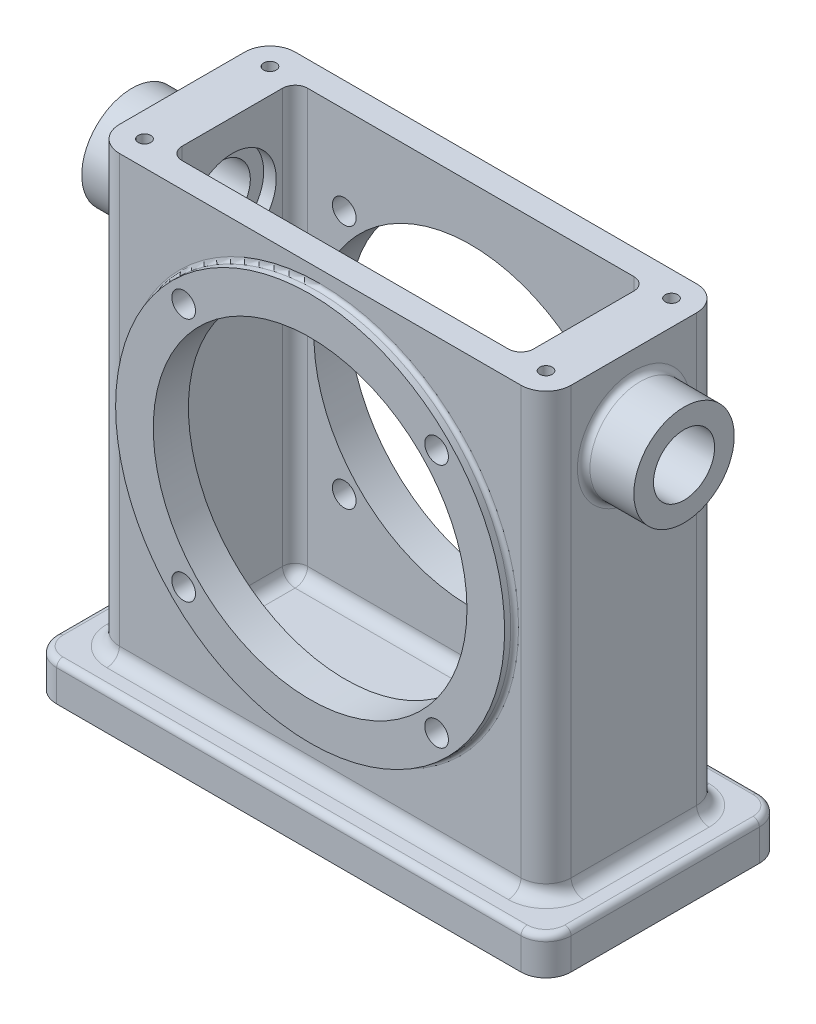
from build123d import *

# Parameters (mm, degrees)
SKETCH1_W                = 130.175
SKETCH1_H                = 60.325
BASE_EXTRUDE_DEPTH       = 9.525
SKETCH2_W                = 114.3
SKETCH2_H                = 44.45
BOSS_EXTRUDE1_DEPTH      = 111.125
FILLET1_R                = 6.35
FILLET2_R                = 1.5875
FILLET3_R                = 3.175
CUT_EXTRUDE1_DEPTH       = 107.95
FILLET4_R                = 3.175
SKETCH4_R                = 49.2125
BOSS_EXTRUDE2_DEPTH      = 2.54
SKETCH5_R                = 39.6875
CUT_EXTRUDE2_DEPTH       = 148.681533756
FILLET5_R                = 0.9906
SKETCH6_R                = 12.7
BOSS_EXTRUDE3_DEPTH      = 12.7
SKETCH7_R                = 7.7343
CUT_EXTRUDE3_DEPTH       = 166.724659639
SKETCH8_R                = 11.1125
CUT_EXTRUDE4_DEPTH       = 3.175
FILLET6_R                = 1.5875
F_6_0_6_DIAMETER_HOLE1_D = 6
SKETCH10_R               = 1.5875
CUT_EXTRUDE6_DEPTH       = 19.05


with BuildPart() as part:
    # Sketch1 → Base-Extrude (new body)
    with BuildSketch(Plane(origin=(0, 0, 0), x_dir=(1, 0, 0), z_dir=(0, 1, 0))):
        Rectangle(SKETCH1_W, SKETCH1_H)
    extrude(amount=BASE_EXTRUDE_DEPTH)

    # Sketch2 → Boss-Extrude1 (add)
    with BuildSketch(Plane(origin=(0, 9.525, 0), x_dir=(-1, 0, 0), z_dir=(0, 1, 0))):
        Rectangle(SKETCH2_W, SKETCH2_H)
    extrude(amount=BOSS_EXTRUDE1_DEPTH)

    # Fillet1
    fillet1_edges = [part.edges().sort_by_distance(p)[0] for p in [
        (-57.15, 65.0875, -22.225),
        (-57.15, 65.0875, 22.225),
        (57.15, 65.0875, 22.225),
        (57.15, 65.0875, -22.225),
        (-65.0875, 4.7625, -30.1625),
        (65.0875, 4.7625, -30.1625),
        (65.0875, 4.7625, 30.1625),
        (-65.0875, 4.7625, 30.1625),
    ]]
    fillet(fillet1_edges, radius=FILLET1_R)

    # Fillet2
    fillet2_edges = [part.edges().sort_by_distance(p)[0] for p in [
        (0, 9.525, 30.1625),
        (-65.0875, 9.525, 0),
        (65.0875, 9.525, 0),
        (0, 9.525, -30.1625),
        (-63.227628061, 9.525, -28.302628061),
        (63.227628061, 9.525, 28.302628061),
        (63.227628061, 9.525, -28.302628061),
        (-63.227628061, 9.525, 28.302628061),
    ]]
    fillet(fillet2_edges, radius=FILLET2_R)

    # Fillet3
    fillet3_edges = [part.edges().sort_by_distance(p)[0] for p in [
        (-57.15, 9.525, 0),
        (0, 9.525, -22.225),
        (57.15, 9.525, 0),
        (0, 9.525, 22.225),
        (-55.290128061, 9.525, 20.365128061),
        (-55.290128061, 9.525, -20.365128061),
        (55.290128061, 9.525, 20.365128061),
        (55.290128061, 9.525, -20.365128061),
    ]]
    fillet(fillet3_edges, radius=FILLET3_R)

    # Sketch3 → Cut-Extrude1 (cut)
    with BuildSketch(Plane(origin=(0, 120.65, 0), x_dir=(-1, 0, 0), z_dir=(0, 1, 0))):
        with BuildLine():
            Line((41.275, 15.875), (-41.275, 15.875))
            ThreePointArc((-41.275, 15.875), (-43.52006403, 14.94506403), (-44.45, 12.7))
            Line((-44.45, 12.7), (-44.45, -12.7))
            ThreePointArc((-44.45, -12.7), (-43.52006403, -14.94506403), (-41.275, -15.875))
            Line((-41.275, -15.875), (41.275, -15.875))
            ThreePointArc((41.275, -15.875), (43.52006403, -14.94506403), (44.45, -12.7))
            Line((44.45, -12.7), (44.45, 12.7))
            ThreePointArc((44.45, 12.7), (43.52006403, 14.94506403), (41.275, 15.875))
        make_face()
    extrude(amount=-CUT_EXTRUDE1_DEPTH, mode=Mode.SUBTRACT)

    # Fillet4
    fillet4_edges = [part.edges().sort_by_distance(p)[0] for p in [
        (43.52006403, 12.7, 14.94506403),
        (0, 12.7, 15.875),
        (-43.52006403, 12.7, 14.94506403),
        (-44.45, 12.7, 0),
        (-43.52006403, 12.7, -14.94506403),
        (0, 12.7, -15.875),
        (43.52006403, 12.7, -14.94506403),
        (44.45, 12.7, 0),
    ]]
    fillet(fillet4_edges, radius=FILLET4_R)

    # Sketch4 → Boss-Extrude2 (add)
    with BuildSketch(Plane.XY.offset(22.225)):
        with Locations(Location((0, 67.31, 0), (0, 0, 180))):
            Circle(SKETCH4_R)
    boss_extrude2 = extrude(amount=BOSS_EXTRUDE2_DEPTH)

    # Mirror1: Boss-Extrude2 across plane
    add(boss_extrude2.mirror(Plane.XY))

    # Sketch5 → Cut-Extrude2 (cut, through all)
    with BuildSketch(Plane.XY.offset(24.765)):
        with Locations((0, 67.31)):
            Circle(SKETCH5_R)
    extrude(amount=-CUT_EXTRUDE2_DEPTH, mode=Mode.SUBTRACT)

    # Fillet5
    fillet5_edges = [part.edges().sort_by_distance(p)[0] for p in [
        (49.2125, 67.31, 22.225),
        (49.2125, 67.31, -22.225),
    ]]
    fillet(fillet5_edges, radius=FILLET5_R)

    # Sketch6 → Boss-Extrude3 (add)
    with BuildSketch(Plane(origin=(57.15, 0, 0), x_dir=(0, 0, -1), z_dir=(1, 0, 0))):
        with Locations(Location((0, 101.6, 0), (0, 0, 180))):
            Circle(SKETCH6_R)
    boss_extrude3 = extrude(amount=BOSS_EXTRUDE3_DEPTH)

    # Sketch7 → Cut-Extrude3 (cut, through all)
    with BuildSketch(Plane.ZY.offset(-44.45)):
        with Locations((0, 101.6)):
            Circle(SKETCH7_R)
    cut_extrude3 = extrude(amount=-CUT_EXTRUDE3_DEPTH, mode=Mode.SUBTRACT)

    # Sketch8 → Cut-Extrude4 (cut)
    with BuildSketch(Plane.ZY.offset(-44.45)):
        with Locations((0, 101.6)):
            Circle(SKETCH8_R)
    cut_extrude4 = extrude(amount=-CUT_EXTRUDE4_DEPTH, mode=Mode.SUBTRACT)

    # Mirror3: Boss-Extrude3, Cut-Extrude3, Cut-Extrude4 across plane
    add(boss_extrude3.mirror(Plane(origin=(0, 0, 0), x_dir=(0, 0, 1), z_dir=(1, 0, 0))))
    add(cut_extrude3.mirror(Plane(origin=(0, 0, 0), x_dir=(0, 0, 1), z_dir=(1, 0, 0))), mode=Mode.SUBTRACT)
    add(cut_extrude4.mirror(Plane(origin=(0, 0, 0), x_dir=(0, 0, 1), z_dir=(1, 0, 0))), mode=Mode.SUBTRACT)

    # Fillet6
    fillet6_edges = [part.edges().sort_by_distance(p)[0] for p in [
        (57.15, 101.6, -12.7),
        (-57.15, 101.6, -12.7),
    ]]
    fillet(fillet6_edges, radius=FILLET6_R)

    # 6.0 _6_ Diameter Hole1 (through all)
    with Locations(Plane.XY.offset(24.765)):
        with Locations((32, 98.31), (-32, 98.31), (-32, 36.31), (32, 36.31)):
            Hole(F_6_0_6_DIAMETER_HOLE1_D / 2)

    # Sketch10 → Cut-Extrude6 (cut)
    with BuildSketch(Plane(origin=(0, 120.65, 0), x_dir=(-1, 0, 0), z_dir=(0, 1, 0))):
        with Locations(Location((-50.8, -15.875, 0), (0, 0, 90))):
            Circle(SKETCH10_R)
        with Locations(Location((-50.8, 15.875, 0), (0, 0, 90))):
            Circle(SKETCH10_R)
    cut_extrude6 = extrude(amount=-CUT_EXTRUDE6_DEPTH, mode=Mode.SUBTRACT)

    # Mirror4: Cut-Extrude6 across plane
    add(cut_extrude6.mirror(Plane(origin=(0, 0, 0), x_dir=(0, 0, 1), z_dir=(1, 0, 0))), mode=Mode.SUBTRACT)


solid = part.part
